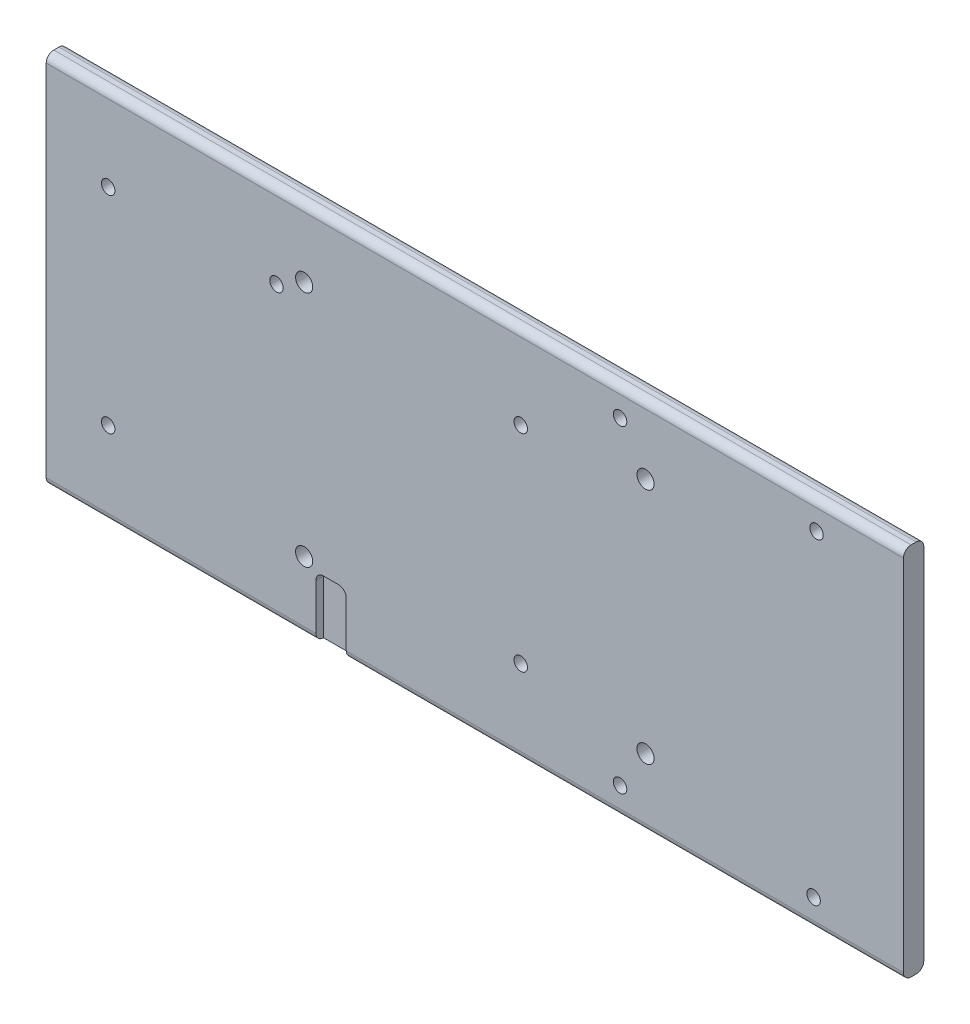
ISO-10303-21;
HEADER;
FILE_DESCRIPTION(('STEP AP214'),'2;1');
FILE_NAME('part.step','',(''),(''),'','','');
FILE_SCHEMA(('AUTOMOTIVE_DESIGN { 1 0 10303 214 1 1 1 1 }'));
ENDSEC;
DATA;
#1=APPLICATION_CONTEXT('core data for automotive mechanical design processes');
#2=APPLICATION_PROTOCOL_DEFINITION('international standard','automotive_design',2000,#1);
#3=PRODUCT_CONTEXT('',#1,'mechanical');
#4=PRODUCT('Part','Part','',(#3));
#5=PRODUCT_RELATED_PRODUCT_CATEGORY('part','',(#4));
#6=PRODUCT_DEFINITION_FORMATION('','',#4);
#7=PRODUCT_DEFINITION_CONTEXT('part definition',#1,'design');
#8=PRODUCT_DEFINITION('design','',#6,#7);
#9=PRODUCT_DEFINITION_SHAPE('','',#8);
#10=(LENGTH_UNIT() NAMED_UNIT(*) SI_UNIT(.MILLI.,.METRE.));
#11=(NAMED_UNIT(*) PLANE_ANGLE_UNIT() SI_UNIT($,.RADIAN.));
#12=(NAMED_UNIT(*) SI_UNIT($,.STERADIAN.) SOLID_ANGLE_UNIT());
#13=UNCERTAINTY_MEASURE_WITH_UNIT(LENGTH_MEASURE(1.E-05),#10,'distance_accuracy_value','');
#14=(GEOMETRIC_REPRESENTATION_CONTEXT(3) GLOBAL_UNCERTAINTY_ASSIGNED_CONTEXT((#13)) GLOBAL_UNIT_ASSIGNED_CONTEXT((#10,
#11,#12)) REPRESENTATION_CONTEXT('',''));
#15=CARTESIAN_POINT('',(0.,0.,0.));
#16=DIRECTION('',(0.,0.,1.));
#17=DIRECTION('',(1.,0.,0.));
#18=AXIS2_PLACEMENT_3D('',#15,#16,#17);
#19=CARTESIAN_POINT('',(0.,-5.00000000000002,1.68));
#20=DIRECTION('',(-1.,0.,0.));
#21=DIRECTION('',(0.,-1.,0.));
#22=AXIS2_PLACEMENT_3D('',#19,#20,#21);
#23=CYLINDRICAL_SURFACE('',#22,1.);
#24=CARTESIAN_POINT('',(29.55,-5.00000000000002,1.68));
#25=DIRECTION('',(-1.,0.,0.));
#26=DIRECTION('',(0.,0.,1.));
#27=AXIS2_PLACEMENT_3D('',#24,#25,#26);
#28=CIRCLE('',#27,1.);
#29=CARTESIAN_POINT('',(29.55,-5.00000000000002,2.68));
#30=VERTEX_POINT('',#29);
#31=CARTESIAN_POINT('',(29.55,-6.00000000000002,1.68));
#32=VERTEX_POINT('',#31);
#33=EDGE_CURVE('E177',#30,#32,#28,.F.);
#34=ORIENTED_EDGE('',*,*,#33,.F.);
#35=DIRECTION('',(1.,0.,0.));
#36=VECTOR('',#35,1.);
#37=CARTESIAN_POINT('',(0.,-5.00000000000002,2.68));
#38=LINE('',#37,#36);
#39=CARTESIAN_POINT('',(-6.,-5.00000000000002,2.68));
#40=VERTEX_POINT('',#39);
#41=EDGE_CURVE('E288',#40,#30,#38,.T.);
#42=ORIENTED_EDGE('',*,*,#41,.F.);
#43=CARTESIAN_POINT('',(-6.,-5.00000000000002,1.68));
#44=DIRECTION('',(-1.,0.,0.));
#45=DIRECTION('',(0.,-1.,0.));
#46=AXIS2_PLACEMENT_3D('',#43,#44,#45);
#47=CIRCLE('',#46,1.);
#48=CARTESIAN_POINT('',(-6.,-6.00000000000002,1.68));
#49=VERTEX_POINT('',#48);
#50=EDGE_CURVE('E295',#49,#40,#47,.T.);
#51=ORIENTED_EDGE('',*,*,#50,.F.);
#52=DIRECTION('',(1.,0.,0.));
#53=VECTOR('',#52,1.);
#54=CARTESIAN_POINT('',(0.,-6.00000000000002,1.68));
#55=LINE('',#54,#53);
#56=EDGE_CURVE('E291',#32,#49,#55,.F.);
#57=ORIENTED_EDGE('',*,*,#56,.F.);
#58=EDGE_LOOP('',(#34,#42,#51,#57));
#59=FACE_BOUND('',#58,.T.);
#60=ADVANCED_FACE('F32',(#59),#23,.T.);
#61=CARTESIAN_POINT('',(0.,42.32,1.));
#62=DIRECTION('',(1.,0.,0.));
#63=DIRECTION('',(0.,1.,0.));
#64=AXIS2_PLACEMENT_3D('',#61,#62,#63);
#65=CYLINDRICAL_SURFACE('',#64,1.);
#66=DIRECTION('',(1.,0.,0.));
#67=VECTOR('',#66,1.);
#68=CARTESIAN_POINT('',(0.,42.32,0.));
#69=LINE('',#68,#67);
#70=CARTESIAN_POINT('',(-6.00000000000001,42.32,0.));
#71=VERTEX_POINT('',#70);
#72=CARTESIAN_POINT('',(107.,42.32,0.));
#73=VERTEX_POINT('',#72);
#74=EDGE_CURVE('E310',#71,#73,#69,.T.);
#75=ORIENTED_EDGE('',*,*,#74,.F.);
#76=CARTESIAN_POINT('',(-6.00000000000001,42.32,1.));
#77=DIRECTION('',(-1.,0.,0.));
#78=DIRECTION('',(0.,-1.,0.));
#79=AXIS2_PLACEMENT_3D('',#76,#77,#78);
#80=CIRCLE('',#79,1.);
#81=CARTESIAN_POINT('',(-6.00000000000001,43.32,0.999999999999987));
#82=VERTEX_POINT('',#81);
#83=EDGE_CURVE('E316',#82,#71,#80,.T.);
#84=ORIENTED_EDGE('',*,*,#83,.F.);
#85=DIRECTION('',(1.,0.,0.));
#86=VECTOR('',#85,1.);
#87=CARTESIAN_POINT('',(107.,43.32,1.));
#88=LINE('',#87,#86);
#89=CARTESIAN_POINT('',(107.,43.32,0.999999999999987));
#90=VERTEX_POINT('',#89);
#91=EDGE_CURVE('E313',#90,#82,#88,.F.);
#92=ORIENTED_EDGE('',*,*,#91,.F.);
#93=CARTESIAN_POINT('',(107.,42.32,1.));
#94=DIRECTION('',(1.,0.,0.));
#95=DIRECTION('',(0.,0.,-1.));
#96=AXIS2_PLACEMENT_3D('',#93,#94,#95);
#97=CIRCLE('',#96,1.);
#98=EDGE_CURVE('E40',#73,#90,#97,.T.);
#99=ORIENTED_EDGE('',*,*,#98,.F.);
#100=EDGE_LOOP('',(#75,#84,#92,#99));
#101=FACE_BOUND('',#100,.T.);
#102=ADVANCED_FACE('F34',(#101),#65,.T.);
#103=CARTESIAN_POINT('',(0.,-5.00000000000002,1.));
#104=DIRECTION('',(-1.,0.,0.));
#105=DIRECTION('',(0.,-1.,0.));
#106=AXIS2_PLACEMENT_3D('',#103,#104,#105);
#107=CYLINDRICAL_SURFACE('',#106,1.);
#108=DIRECTION('',(-1.,0.,0.));
#109=VECTOR('',#108,1.);
#110=CARTESIAN_POINT('',(0.,-5.00000000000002,0.));
#111=LINE('',#110,#109);
#112=CARTESIAN_POINT('',(107.,-5.00000000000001,0.));
#113=VERTEX_POINT('',#112);
#114=CARTESIAN_POINT('',(-6.,-5.00000000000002,0.));
#115=VERTEX_POINT('',#114);
#116=EDGE_CURVE('E300',#113,#115,#111,.T.);
#117=ORIENTED_EDGE('',*,*,#116,.F.);
#118=CARTESIAN_POINT('',(107.,-5.00000000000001,1.));
#119=DIRECTION('',(1.,0.,0.));
#120=DIRECTION('',(0.,0.,-1.));
#121=AXIS2_PLACEMENT_3D('',#118,#119,#120);
#122=CIRCLE('',#121,1.);
#123=CARTESIAN_POINT('',(107.,-6.00000000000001,0.999999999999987));
#124=VERTEX_POINT('',#123);
#125=EDGE_CURVE('E306',#124,#113,#122,.T.);
#126=ORIENTED_EDGE('',*,*,#125,.F.);
#127=DIRECTION('',(-1.,0.,0.));
#128=VECTOR('',#127,1.);
#129=CARTESIAN_POINT('',(107.,-6.00000000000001,1.));
#130=LINE('',#129,#128);
#131=CARTESIAN_POINT('',(-6.,-6.00000000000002,0.999999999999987));
#132=VERTEX_POINT('',#131);
#133=EDGE_CURVE('E303',#132,#124,#130,.F.);
#134=ORIENTED_EDGE('',*,*,#133,.F.);
#135=CARTESIAN_POINT('',(-6.,-5.00000000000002,1.));
#136=DIRECTION('',(-1.,0.,0.));
#137=DIRECTION('',(0.,-1.,0.));
#138=AXIS2_PLACEMENT_3D('',#135,#136,#137);
#139=CIRCLE('',#138,1.);
#140=EDGE_CURVE('E308',#115,#132,#139,.T.);
#141=ORIENTED_EDGE('',*,*,#140,.F.);
#142=EDGE_LOOP('',(#117,#126,#134,#141));
#143=FACE_BOUND('',#142,.T.);
#144=ADVANCED_FACE('F329',(#143),#107,.T.);
#145=CARTESIAN_POINT('',(33.55,-5.00000000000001,1.68));
#146=DIRECTION('',(1.,0.,0.));
#147=DIRECTION('',(0.,0.,-1.));
#148=AXIS2_PLACEMENT_3D('',#145,#146,#147);
#149=CIRCLE('',#148,1.);
#150=CARTESIAN_POINT('',(33.55,-6.00000000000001,1.68));
#151=VERTEX_POINT('',#150);
#152=CARTESIAN_POINT('',(33.55,-5.00000000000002,2.68));
#153=VERTEX_POINT('',#152);
#154=EDGE_CURVE('E172',#151,#153,#149,.F.);
#155=ORIENTED_EDGE('',*,*,#154,.F.);
#156=CARTESIAN_POINT('',(107.,-6.00000000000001,1.68));
#157=VERTEX_POINT('',#156);
#158=EDGE_CURVE('E292',#157,#151,#55,.F.);
#159=ORIENTED_EDGE('',*,*,#158,.F.);
#160=CARTESIAN_POINT('',(107.,-5.00000000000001,1.68));
#161=DIRECTION('',(1.,0.,0.));
#162=DIRECTION('',(0.,0.,-1.));
#163=AXIS2_PLACEMENT_3D('',#160,#161,#162);
#164=CIRCLE('',#163,1.);
#165=CARTESIAN_POINT('',(107.,-5.00000000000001,2.68));
#166=VERTEX_POINT('',#165);
#167=EDGE_CURVE('E297',#166,#157,#164,.T.);
#168=ORIENTED_EDGE('',*,*,#167,.F.);
#169=EDGE_CURVE('E287',#153,#166,#38,.T.);
#170=ORIENTED_EDGE('',*,*,#169,.F.);
#171=EDGE_LOOP('',(#155,#159,#168,#170));
#172=FACE_BOUND('',#171,.T.);
#173=ADVANCED_FACE('F357',(#172),#23,.T.);
#174=CARTESIAN_POINT('',(0.,42.32,1.68));
#175=DIRECTION('',(1.,0.,0.));
#176=DIRECTION('',(0.,1.,0.));
#177=AXIS2_PLACEMENT_3D('',#174,#175,#176);
#178=CYLINDRICAL_SURFACE('',#177,1.);
#179=DIRECTION('',(-1.,0.,0.));
#180=VECTOR('',#179,1.);
#181=CARTESIAN_POINT('',(0.,42.32,2.68));
#182=LINE('',#181,#180);
#183=CARTESIAN_POINT('',(107.,42.32,2.68));
#184=VERTEX_POINT('',#183);
#185=CARTESIAN_POINT('',(-6.00000000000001,42.32,2.68));
#186=VERTEX_POINT('',#185);
#187=EDGE_CURVE('E273',#184,#186,#182,.T.);
#188=ORIENTED_EDGE('',*,*,#187,.F.);
#189=CARTESIAN_POINT('',(107.,42.32,1.68));
#190=DIRECTION('',(1.,0.,0.));
#191=DIRECTION('',(0.,0.,-1.));
#192=AXIS2_PLACEMENT_3D('',#189,#190,#191);
#193=CIRCLE('',#192,1.);
#194=CARTESIAN_POINT('',(107.,43.32,1.68));
#195=VERTEX_POINT('',#194);
#196=EDGE_CURVE('E281',#195,#184,#193,.T.);
#197=ORIENTED_EDGE('',*,*,#196,.F.);
#198=DIRECTION('',(-1.,0.,0.));
#199=VECTOR('',#198,1.);
#200=CARTESIAN_POINT('',(0.,43.32,1.68));
#201=LINE('',#200,#199);
#202=CARTESIAN_POINT('',(-6.00000000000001,43.32,1.68));
#203=VERTEX_POINT('',#202);
#204=EDGE_CURVE('E278',#203,#195,#201,.F.);
#205=ORIENTED_EDGE('',*,*,#204,.F.);
#206=CARTESIAN_POINT('',(-6.00000000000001,42.32,1.68));
#207=DIRECTION('',(-1.,0.,0.));
#208=DIRECTION('',(0.,-1.,0.));
#209=AXIS2_PLACEMENT_3D('',#206,#207,#208);
#210=CIRCLE('',#209,1.);
#211=EDGE_CURVE('E284',#186,#203,#210,.T.);
#212=ORIENTED_EDGE('',*,*,#211,.F.);
#213=EDGE_LOOP('',(#188,#197,#205,#212));
#214=FACE_BOUND('',#213,.T.);
#215=ADVANCED_FACE('F346',(#214),#178,.T.);
#216=CARTESIAN_POINT('',(0.,37.32,2.68));
#217=DIRECTION('',(0.,0.,-1.));
#218=DIRECTION('',(-1.,0.,0.));
#219=AXIS2_PLACEMENT_3D('',#216,#217,#218);
#220=PLANE('',#219);
#221=CARTESIAN_POINT('',(69.640955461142,-2.31578707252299,2.68));
#222=DIRECTION('',(0.,0.,-1.));
#223=DIRECTION('',(-1.,0.,0.));
#224=AXIS2_PLACEMENT_3D('',#221,#222,#223);
#225=CIRCLE('',#224,0.889000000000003);
#226=CARTESIAN_POINT('',(68.751955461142,-2.31578707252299,2.68));
#227=VERTEX_POINT('',#226);
#228=EDGE_CURVE('E180',#227,#227,#225,.T.);
#229=ORIENTED_EDGE('',*,*,#228,.T.);
#230=EDGE_LOOP('',(#229));
#231=FACE_BOUND('',#230,.T.);
#232=CARTESIAN_POINT('',(95.1549255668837,-2.31578707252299,2.68));
#233=DIRECTION('',(0.,0.,-1.));
#234=DIRECTION('',(-1.,0.,0.));
#235=AXIS2_PLACEMENT_3D('',#232,#233,#234);
#236=CIRCLE('',#235,0.889000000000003);
#237=CARTESIAN_POINT('',(94.2659255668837,-2.31578707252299,2.68));
#238=VERTEX_POINT('',#237);
#239=EDGE_CURVE('E186',#238,#238,#236,.T.);
#240=ORIENTED_EDGE('',*,*,#239,.T.);
#241=EDGE_LOOP('',(#240));
#242=FACE_BOUND('',#241,.T.);
#243=CARTESIAN_POINT('',(95.5374680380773,39.635787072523,2.68));
#244=DIRECTION('',(0.,0.,-1.));
#245=DIRECTION('',(-1.,0.,0.));
#246=AXIS2_PLACEMENT_3D('',#243,#244,#245);
#247=CIRCLE('',#246,0.889000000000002);
#248=CARTESIAN_POINT('',(94.6484680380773,39.635787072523,2.68));
#249=VERTEX_POINT('',#248);
#250=EDGE_CURVE('E192',#249,#249,#247,.T.);
#251=ORIENTED_EDGE('',*,*,#250,.T.);
#252=EDGE_LOOP('',(#251));
#253=FACE_BOUND('',#252,.T.);
#254=CARTESIAN_POINT('',(69.640955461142,39.635787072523,2.68));
#255=DIRECTION('',(0.,0.,-1.));
#256=DIRECTION('',(-1.,0.,0.));
#257=AXIS2_PLACEMENT_3D('',#254,#255,#256);
#258=CIRCLE('',#257,0.889000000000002);
#259=CARTESIAN_POINT('',(68.751955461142,39.635787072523,2.68));
#260=VERTEX_POINT('',#259);
#261=EDGE_CURVE('E198',#260,#260,#258,.T.);
#262=ORIENTED_EDGE('',*,*,#261,.T.);
#263=EDGE_LOOP('',(#262));
#264=FACE_BOUND('',#263,.T.);
#265=CARTESIAN_POINT('',(2.16398911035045,32.27,2.68));
#266=DIRECTION('',(0.,0.,-1.));
#267=DIRECTION('',(-1.,0.,0.));
#268=AXIS2_PLACEMENT_3D('',#265,#266,#267);
#269=CIRCLE('',#268,0.888999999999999);
#270=CARTESIAN_POINT('',(1.27498911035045,32.27,2.68));
#271=VERTEX_POINT('',#270);
#272=EDGE_CURVE('E204',#271,#271,#269,.T.);
#273=ORIENTED_EDGE('',*,*,#272,.T.);
#274=EDGE_LOOP('',(#273));
#275=FACE_BOUND('',#274,.T.);
#276=CARTESIAN_POINT('',(56.55,32.27,2.68));
#277=DIRECTION('',(0.,0.,-1.));
#278=DIRECTION('',(-1.,0.,0.));
#279=AXIS2_PLACEMENT_3D('',#276,#277,#278);
#280=CIRCLE('',#279,0.889000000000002);
#281=CARTESIAN_POINT('',(55.661,32.27,2.68));
#282=VERTEX_POINT('',#281);
#283=EDGE_CURVE('E210',#282,#282,#280,.T.);
#284=ORIENTED_EDGE('',*,*,#283,.T.);
#285=EDGE_LOOP('',(#284));
#286=FACE_BOUND('',#285,.T.);
#287=CARTESIAN_POINT('',(56.55,5.05,2.68));
#288=DIRECTION('',(0.,0.,-1.));
#289=DIRECTION('',(-1.,0.,0.));
#290=AXIS2_PLACEMENT_3D('',#287,#288,#289);
#291=CIRCLE('',#290,0.889000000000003);
#292=CARTESIAN_POINT('',(55.661,5.05,2.68));
#293=VERTEX_POINT('',#292);
#294=EDGE_CURVE('E216',#293,#293,#291,.T.);
#295=ORIENTED_EDGE('',*,*,#294,.T.);
#296=EDGE_LOOP('',(#295));
#297=FACE_BOUND('',#296,.T.);
#298=CARTESIAN_POINT('',(2.16398911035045,5.04999999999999,2.68));
#299=DIRECTION('',(0.,0.,-1.));
#300=DIRECTION('',(-1.,0.,0.));
#301=AXIS2_PLACEMENT_3D('',#298,#299,#300);
#302=CIRCLE('',#301,0.889);
#303=CARTESIAN_POINT('',(1.27498911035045,5.04999999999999,2.68));
#304=VERTEX_POINT('',#303);
#305=EDGE_CURVE('E222',#304,#304,#302,.T.);
#306=ORIENTED_EDGE('',*,*,#305,.T.);
#307=EDGE_LOOP('',(#306));
#308=FACE_BOUND('',#307,.T.);
#309=CARTESIAN_POINT('',(24.355,32.27,2.68));
#310=DIRECTION('',(0.,0.,-1.));
#311=DIRECTION('',(-1.,0.,0.));
#312=AXIS2_PLACEMENT_3D('',#309,#310,#311);
#313=CIRCLE('',#312,0.888999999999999);
#314=CARTESIAN_POINT('',(23.466,32.27,2.68));
#315=VERTEX_POINT('',#314);
#316=EDGE_CURVE('E228',#315,#315,#313,.T.);
#317=ORIENTED_EDGE('',*,*,#316,.T.);
#318=EDGE_LOOP('',(#317));
#319=FACE_BOUND('',#318,.T.);
#320=CARTESIAN_POINT('',(73.,3.,2.68));
#321=DIRECTION('',(0.,0.,-1.));
#322=DIRECTION('',(-1.,0.,0.));
#323=AXIS2_PLACEMENT_3D('',#320,#321,#322);
#324=CIRCLE('',#323,1.1303);
#325=CARTESIAN_POINT('',(71.8697,3.,2.68));
#326=VERTEX_POINT('',#325);
#327=EDGE_CURVE('E252',#326,#326,#324,.T.);
#328=ORIENTED_EDGE('',*,*,#327,.T.);
#329=EDGE_LOOP('',(#328));
#330=FACE_BOUND('',#329,.T.);
#331=CARTESIAN_POINT('',(73.,34.32,2.68));
#332=DIRECTION('',(0.,0.,-1.));
#333=DIRECTION('',(-1.,0.,0.));
#334=AXIS2_PLACEMENT_3D('',#331,#332,#333);
#335=CIRCLE('',#334,1.1303);
#336=CARTESIAN_POINT('',(71.8697,34.32,2.68));
#337=VERTEX_POINT('',#336);
#338=EDGE_CURVE('E258',#337,#337,#335,.T.);
#339=ORIENTED_EDGE('',*,*,#338,.T.);
#340=EDGE_LOOP('',(#339));
#341=FACE_BOUND('',#340,.T.);
#342=CARTESIAN_POINT('',(28.,34.32,2.68));
#343=DIRECTION('',(0.,0.,-1.));
#344=DIRECTION('',(-1.,0.,0.));
#345=AXIS2_PLACEMENT_3D('',#342,#343,#344);
#346=CIRCLE('',#345,1.1303);
#347=CARTESIAN_POINT('',(26.8697,34.32,2.68));
#348=VERTEX_POINT('',#347);
#349=EDGE_CURVE('E264',#348,#348,#346,.T.);
#350=ORIENTED_EDGE('',*,*,#349,.T.);
#351=EDGE_LOOP('',(#350));
#352=FACE_BOUND('',#351,.T.);
#353=CARTESIAN_POINT('',(28.,3.,2.68));
#354=DIRECTION('',(0.,0.,-1.));
#355=DIRECTION('',(-1.,0.,0.));
#356=AXIS2_PLACEMENT_3D('',#353,#354,#355);
#357=CIRCLE('',#356,1.1303);
#358=CARTESIAN_POINT('',(26.8697,3.,2.68));
#359=VERTEX_POINT('',#358);
#360=EDGE_CURVE('E270',#359,#359,#357,.T.);
#361=ORIENTED_EDGE('',*,*,#360,.T.);
#362=EDGE_LOOP('',(#361));
#363=FACE_BOUND('',#362,.T.);
#364=ORIENTED_EDGE('',*,*,#41,.T.);
#365=DIRECTION('',(0.,-1.,0.));
#366=VECTOR('',#365,1.);
#367=CARTESIAN_POINT('',(29.55,-5.00000000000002,2.68));
#368=LINE('',#367,#366);
#369=CARTESIAN_POINT('',(29.55,1.04999999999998,2.68));
#370=VERTEX_POINT('',#369);
#371=EDGE_CURVE('E142',#370,#30,#368,.T.);
#372=ORIENTED_EDGE('',*,*,#371,.F.);
#373=CARTESIAN_POINT('',(30.55,1.04999999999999,2.68));
#374=DIRECTION('',(0.,0.,1.));
#375=DIRECTION('',(1.,0.,0.));
#376=AXIS2_PLACEMENT_3D('',#373,#374,#375);
#377=CIRCLE('',#376,1.);
#378=CARTESIAN_POINT('',(30.55,2.04999999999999,2.68));
#379=VERTEX_POINT('',#378);
#380=EDGE_CURVE('E166',#379,#370,#377,.T.);
#381=ORIENTED_EDGE('',*,*,#380,.F.);
#382=DIRECTION('',(-1.,0.,0.));
#383=VECTOR('',#382,1.);
#384=CARTESIAN_POINT('',(30.55,2.04999999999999,2.68));
#385=LINE('',#384,#383);
#386=CARTESIAN_POINT('',(32.55,2.04999999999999,2.68));
#387=VERTEX_POINT('',#386);
#388=EDGE_CURVE('E163',#387,#379,#385,.T.);
#389=ORIENTED_EDGE('',*,*,#388,.F.);
#390=CARTESIAN_POINT('',(32.55,1.04999999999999,2.68));
#391=DIRECTION('',(0.,0.,1.));
#392=DIRECTION('',(1.,0.,0.));
#393=AXIS2_PLACEMENT_3D('',#390,#391,#392);
#394=CIRCLE('',#393,1.);
#395=CARTESIAN_POINT('',(33.55,1.04999999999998,2.68));
#396=VERTEX_POINT('',#395);
#397=EDGE_CURVE('E161',#396,#387,#394,.T.);
#398=ORIENTED_EDGE('',*,*,#397,.F.);
#399=DIRECTION('',(0.,-1.,0.));
#400=VECTOR('',#399,1.);
#401=CARTESIAN_POINT('',(33.55,37.32,2.68));
#402=LINE('',#401,#400);
#403=EDGE_CURVE('E11',#396,#153,#402,.T.);
#404=ORIENTED_EDGE('',*,*,#403,.T.);
#405=ORIENTED_EDGE('',*,*,#169,.T.);
#406=DIRECTION('',(0.,1.,0.));
#407=VECTOR('',#406,1.);
#408=CARTESIAN_POINT('',(107.,-6.00000000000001,2.68));
#409=LINE('',#408,#407);
#410=EDGE_CURVE('E238',#166,#184,#409,.T.);
#411=ORIENTED_EDGE('',*,*,#410,.T.);
#412=ORIENTED_EDGE('',*,*,#187,.T.);
#413=DIRECTION('',(0.,-1.,0.));
#414=VECTOR('',#413,1.);
#415=CARTESIAN_POINT('',(-6.,-6.00000000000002,2.68));
#416=LINE('',#415,#414);
#417=EDGE_CURVE('E234',#186,#40,#416,.T.);
#418=ORIENTED_EDGE('',*,*,#417,.T.);
#419=EDGE_LOOP('',(#364,#372,#381,#389,#398,#404,#405,#411,#412,#418));
#420=FACE_BOUND('',#419,.T.);
#421=ADVANCED_FACE('F341',(#231,#242,#253,#264,#275,#286,#297,#308,#319,#330,#341,#352,#363,
#420),#220,.F.);
#422=CARTESIAN_POINT('',(0.,37.32,0.));
#423=DIRECTION('',(0.,0.,-1.));
#424=DIRECTION('',(-1.,0.,0.));
#425=AXIS2_PLACEMENT_3D('',#422,#423,#424);
#426=PLANE('',#425);
#427=CARTESIAN_POINT('',(69.640955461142,-2.31578707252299,0.));
#428=DIRECTION('',(0.,0.,-1.));
#429=DIRECTION('',(-1.,0.,0.));
#430=AXIS2_PLACEMENT_3D('',#427,#428,#429);
#431=CIRCLE('',#430,0.889000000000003);
#432=CARTESIAN_POINT('',(68.751955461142,-2.31578707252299,0.));
#433=VERTEX_POINT('',#432);
#434=EDGE_CURVE('E179',#433,#433,#431,.T.);
#435=ORIENTED_EDGE('',*,*,#434,.F.);
#436=EDGE_LOOP('',(#435));
#437=FACE_BOUND('',#436,.T.);
#438=CARTESIAN_POINT('',(95.1549255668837,-2.31578707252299,0.));
#439=DIRECTION('',(0.,0.,-1.));
#440=DIRECTION('',(-1.,0.,0.));
#441=AXIS2_PLACEMENT_3D('',#438,#439,#440);
#442=CIRCLE('',#441,0.889000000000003);
#443=CARTESIAN_POINT('',(94.2659255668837,-2.31578707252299,0.));
#444=VERTEX_POINT('',#443);
#445=EDGE_CURVE('E183',#444,#444,#442,.T.);
#446=ORIENTED_EDGE('',*,*,#445,.F.);
#447=EDGE_LOOP('',(#446));
#448=FACE_BOUND('',#447,.T.);
#449=CARTESIAN_POINT('',(95.5374680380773,39.635787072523,0.));
#450=DIRECTION('',(0.,0.,-1.));
#451=DIRECTION('',(-1.,0.,0.));
#452=AXIS2_PLACEMENT_3D('',#449,#450,#451);
#453=CIRCLE('',#452,0.889000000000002);
#454=CARTESIAN_POINT('',(94.6484680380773,39.635787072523,0.));
#455=VERTEX_POINT('',#454);
#456=EDGE_CURVE('E189',#455,#455,#453,.T.);
#457=ORIENTED_EDGE('',*,*,#456,.F.);
#458=EDGE_LOOP('',(#457));
#459=FACE_BOUND('',#458,.T.);
#460=CARTESIAN_POINT('',(69.640955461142,39.635787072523,0.));
#461=DIRECTION('',(0.,0.,-1.));
#462=DIRECTION('',(-1.,0.,0.));
#463=AXIS2_PLACEMENT_3D('',#460,#461,#462);
#464=CIRCLE('',#463,0.889000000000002);
#465=CARTESIAN_POINT('',(68.751955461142,39.635787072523,0.));
#466=VERTEX_POINT('',#465);
#467=EDGE_CURVE('E195',#466,#466,#464,.T.);
#468=ORIENTED_EDGE('',*,*,#467,.F.);
#469=EDGE_LOOP('',(#468));
#470=FACE_BOUND('',#469,.T.);
#471=CARTESIAN_POINT('',(2.16398911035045,32.27,0.));
#472=DIRECTION('',(0.,0.,-1.));
#473=DIRECTION('',(-1.,0.,0.));
#474=AXIS2_PLACEMENT_3D('',#471,#472,#473);
#475=CIRCLE('',#474,0.888999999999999);
#476=CARTESIAN_POINT('',(1.27498911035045,32.27,0.));
#477=VERTEX_POINT('',#476);
#478=EDGE_CURVE('E201',#477,#477,#475,.T.);
#479=ORIENTED_EDGE('',*,*,#478,.F.);
#480=EDGE_LOOP('',(#479));
#481=FACE_BOUND('',#480,.T.);
#482=CARTESIAN_POINT('',(56.55,32.27,0.));
#483=DIRECTION('',(0.,0.,-1.));
#484=DIRECTION('',(-1.,0.,0.));
#485=AXIS2_PLACEMENT_3D('',#482,#483,#484);
#486=CIRCLE('',#485,0.889000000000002);
#487=CARTESIAN_POINT('',(55.661,32.27,0.));
#488=VERTEX_POINT('',#487);
#489=EDGE_CURVE('E207',#488,#488,#486,.T.);
#490=ORIENTED_EDGE('',*,*,#489,.F.);
#491=EDGE_LOOP('',(#490));
#492=FACE_BOUND('',#491,.T.);
#493=CARTESIAN_POINT('',(56.55,5.05,0.));
#494=DIRECTION('',(0.,0.,-1.));
#495=DIRECTION('',(-1.,0.,0.));
#496=AXIS2_PLACEMENT_3D('',#493,#494,#495);
#497=CIRCLE('',#496,0.889000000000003);
#498=CARTESIAN_POINT('',(55.661,5.05,0.));
#499=VERTEX_POINT('',#498);
#500=EDGE_CURVE('E213',#499,#499,#497,.T.);
#501=ORIENTED_EDGE('',*,*,#500,.F.);
#502=EDGE_LOOP('',(#501));
#503=FACE_BOUND('',#502,.T.);
#504=CARTESIAN_POINT('',(2.16398911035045,5.04999999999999,0.));
#505=DIRECTION('',(0.,0.,-1.));
#506=DIRECTION('',(-1.,0.,0.));
#507=AXIS2_PLACEMENT_3D('',#504,#505,#506);
#508=CIRCLE('',#507,0.889);
#509=CARTESIAN_POINT('',(1.27498911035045,5.04999999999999,0.));
#510=VERTEX_POINT('',#509);
#511=EDGE_CURVE('E219',#510,#510,#508,.T.);
#512=ORIENTED_EDGE('',*,*,#511,.F.);
#513=EDGE_LOOP('',(#512));
#514=FACE_BOUND('',#513,.T.);
#515=CARTESIAN_POINT('',(24.355,32.27,0.));
#516=DIRECTION('',(0.,0.,-1.));
#517=DIRECTION('',(-1.,0.,0.));
#518=AXIS2_PLACEMENT_3D('',#515,#516,#517);
#519=CIRCLE('',#518,0.888999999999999);
#520=CARTESIAN_POINT('',(23.466,32.27,0.));
#521=VERTEX_POINT('',#520);
#522=EDGE_CURVE('E225',#521,#521,#519,.T.);
#523=ORIENTED_EDGE('',*,*,#522,.F.);
#524=EDGE_LOOP('',(#523));
#525=FACE_BOUND('',#524,.T.);
#526=CARTESIAN_POINT('',(73.,3.,0.));
#527=DIRECTION('',(0.,0.,-1.));
#528=DIRECTION('',(-1.,0.,0.));
#529=AXIS2_PLACEMENT_3D('',#526,#527,#528);
#530=CIRCLE('',#529,1.1303);
#531=CARTESIAN_POINT('',(71.8697,3.,0.));
#532=VERTEX_POINT('',#531);
#533=EDGE_CURVE('E237',#532,#532,#530,.T.);
#534=ORIENTED_EDGE('',*,*,#533,.F.);
#535=EDGE_LOOP('',(#534));
#536=FACE_BOUND('',#535,.T.);
#537=CARTESIAN_POINT('',(73.,34.32,0.));
#538=DIRECTION('',(0.,0.,-1.));
#539=DIRECTION('',(-1.,0.,0.));
#540=AXIS2_PLACEMENT_3D('',#537,#538,#539);
#541=CIRCLE('',#540,1.1303);
#542=CARTESIAN_POINT('',(71.8697,34.32,0.));
#543=VERTEX_POINT('',#542);
#544=EDGE_CURVE('E255',#543,#543,#541,.T.);
#545=ORIENTED_EDGE('',*,*,#544,.F.);
#546=EDGE_LOOP('',(#545));
#547=FACE_BOUND('',#546,.T.);
#548=CARTESIAN_POINT('',(28.,34.32,0.));
#549=DIRECTION('',(0.,0.,-1.));
#550=DIRECTION('',(-1.,0.,0.));
#551=AXIS2_PLACEMENT_3D('',#548,#549,#550);
#552=CIRCLE('',#551,1.1303);
#553=CARTESIAN_POINT('',(26.8697,34.32,0.));
#554=VERTEX_POINT('',#553);
#555=EDGE_CURVE('E261',#554,#554,#552,.T.);
#556=ORIENTED_EDGE('',*,*,#555,.F.);
#557=EDGE_LOOP('',(#556));
#558=FACE_BOUND('',#557,.T.);
#559=CARTESIAN_POINT('',(28.,3.,0.));
#560=DIRECTION('',(0.,0.,-1.));
#561=DIRECTION('',(-1.,0.,0.));
#562=AXIS2_PLACEMENT_3D('',#559,#560,#561);
#563=CIRCLE('',#562,1.1303);
#564=CARTESIAN_POINT('',(26.8697,3.,0.));
#565=VERTEX_POINT('',#564);
#566=EDGE_CURVE('E267',#565,#565,#563,.T.);
#567=ORIENTED_EDGE('',*,*,#566,.F.);
#568=EDGE_LOOP('',(#567));
#569=FACE_BOUND('',#568,.T.);
#570=DIRECTION('',(0.,-1.,0.));
#571=VECTOR('',#570,1.);
#572=CARTESIAN_POINT('',(-6.,-6.00000000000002,0.));
#573=LINE('',#572,#571);
#574=EDGE_CURVE('E243',#71,#115,#573,.T.);
#575=ORIENTED_EDGE('',*,*,#574,.F.);
#576=ORIENTED_EDGE('',*,*,#74,.T.);
#577=DIRECTION('',(0.,1.,0.));
#578=VECTOR('',#577,1.);
#579=CARTESIAN_POINT('',(107.,-6.00000000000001,0.));
#580=LINE('',#579,#578);
#581=EDGE_CURVE('E231',#113,#73,#580,.T.);
#582=ORIENTED_EDGE('',*,*,#581,.F.);
#583=ORIENTED_EDGE('',*,*,#116,.T.);
#584=EDGE_LOOP('',(#575,#576,#582,#583));
#585=FACE_BOUND('',#584,.T.);
#586=ADVANCED_FACE('F326',(#437,#448,#459,#470,#481,#492,#503,#514,#525,#536,#547,#558,#569,
#585),#426,.T.);
#587=CARTESIAN_POINT('',(28.,3.,2.68));
#588=DIRECTION('',(0.,0.,-1.));
#589=DIRECTION('',(-1.,0.,0.));
#590=AXIS2_PLACEMENT_3D('',#587,#588,#589);
#591=CYLINDRICAL_SURFACE('',#590,1.1303);
#592=ORIENTED_EDGE('',*,*,#360,.F.);
#593=EDGE_LOOP('',(#592));
#594=FACE_BOUND('',#593,.T.);
#595=ORIENTED_EDGE('',*,*,#566,.T.);
#596=EDGE_LOOP('',(#595));
#597=FACE_BOUND('',#596,.T.);
#598=ADVANCED_FACE('F396',(#594,#597),#591,.F.);
#599=CARTESIAN_POINT('',(28.,34.32,2.68));
#600=DIRECTION('',(0.,0.,-1.));
#601=DIRECTION('',(-1.,0.,0.));
#602=AXIS2_PLACEMENT_3D('',#599,#600,#601);
#603=CYLINDRICAL_SURFACE('',#602,1.1303);
#604=ORIENTED_EDGE('',*,*,#349,.F.);
#605=EDGE_LOOP('',(#604));
#606=FACE_BOUND('',#605,.T.);
#607=ORIENTED_EDGE('',*,*,#555,.T.);
#608=EDGE_LOOP('',(#607));
#609=FACE_BOUND('',#608,.T.);
#610=ADVANCED_FACE('F557',(#606,#609),#603,.F.);
#611=CARTESIAN_POINT('',(73.,34.32,2.68));
#612=DIRECTION('',(0.,0.,-1.));
#613=DIRECTION('',(-1.,0.,0.));
#614=AXIS2_PLACEMENT_3D('',#611,#612,#613);
#615=CYLINDRICAL_SURFACE('',#614,1.1303);
#616=ORIENTED_EDGE('',*,*,#338,.F.);
#617=EDGE_LOOP('',(#616));
#618=FACE_BOUND('',#617,.T.);
#619=ORIENTED_EDGE('',*,*,#544,.T.);
#620=EDGE_LOOP('',(#619));
#621=FACE_BOUND('',#620,.T.);
#622=ADVANCED_FACE('F563',(#618,#621),#615,.F.);
#623=CARTESIAN_POINT('',(73.,3.,2.68));
#624=DIRECTION('',(0.,0.,-1.));
#625=DIRECTION('',(-1.,0.,0.));
#626=AXIS2_PLACEMENT_3D('',#623,#624,#625);
#627=CYLINDRICAL_SURFACE('',#626,1.1303);
#628=ORIENTED_EDGE('',*,*,#327,.F.);
#629=EDGE_LOOP('',(#628));
#630=FACE_BOUND('',#629,.T.);
#631=ORIENTED_EDGE('',*,*,#533,.T.);
#632=EDGE_LOOP('',(#631));
#633=FACE_BOUND('',#632,.T.);
#634=ADVANCED_FACE('F366',(#630,#633),#627,.F.);
#635=CARTESIAN_POINT('',(107.,-6.00000000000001,-123.294210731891));
#636=DIRECTION('',(1.,0.,0.));
#637=DIRECTION('',(0.,0.,-1.));
#638=AXIS2_PLACEMENT_3D('',#635,#636,#637);
#639=PLANE('',#638);
#640=ORIENTED_EDGE('',*,*,#581,.T.);
#641=ORIENTED_EDGE('',*,*,#98,.T.);
#642=DIRECTION('',(0.,0.,1.));
#643=VECTOR('',#642,1.);
#644=CARTESIAN_POINT('',(107.,43.32,-123.294210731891));
#645=LINE('',#644,#643);
#646=EDGE_CURVE('E242',#90,#195,#645,.T.);
#647=ORIENTED_EDGE('',*,*,#646,.T.);
#648=ORIENTED_EDGE('',*,*,#196,.T.);
#649=ORIENTED_EDGE('',*,*,#410,.F.);
#650=ORIENTED_EDGE('',*,*,#167,.T.);
#651=DIRECTION('',(0.,0.,1.));
#652=VECTOR('',#651,1.);
#653=CARTESIAN_POINT('',(107.,-6.00000000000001,-123.294210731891));
#654=LINE('',#653,#652);
#655=EDGE_CURVE('E246',#124,#157,#654,.T.);
#656=ORIENTED_EDGE('',*,*,#655,.F.);
#657=ORIENTED_EDGE('',*,*,#125,.T.);
#658=EDGE_LOOP('',(#640,#641,#647,#648,#649,#650,#656,#657));
#659=FACE_BOUND('',#658,.T.);
#660=ADVANCED_FACE('F350',(#659),#639,.T.);
#661=CARTESIAN_POINT('',(107.,-6.00000000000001,-123.294210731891));
#662=DIRECTION('',(0.,-1.,0.));
#663=DIRECTION('',(1.,0.,0.));
#664=AXIS2_PLACEMENT_3D('',#661,#662,#663);
#665=PLANE('',#664);
#666=DIRECTION('',(0.,0.,1.));
#667=VECTOR('',#666,1.);
#668=CARTESIAN_POINT('',(-6.,-6.00000000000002,-123.294210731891));
#669=LINE('',#668,#667);
#670=EDGE_CURVE('E245',#132,#49,#669,.T.);
#671=ORIENTED_EDGE('',*,*,#670,.F.);
#672=ORIENTED_EDGE('',*,*,#133,.T.);
#673=ORIENTED_EDGE('',*,*,#655,.T.);
#674=ORIENTED_EDGE('',*,*,#158,.T.);
#675=EDGE_CURVE('E139',#151,#32,#55,.F.);
#676=ORIENTED_EDGE('',*,*,#675,.T.);
#677=ORIENTED_EDGE('',*,*,#56,.T.);
#678=EDGE_LOOP('',(#671,#672,#673,#674,#676,#677));
#679=FACE_BOUND('',#678,.T.);
#680=ADVANCED_FACE('F358',(#679),#665,.T.);
#681=CARTESIAN_POINT('',(-6.,-6.00000000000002,-123.294210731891));
#682=DIRECTION('',(-1.,0.,0.));
#683=DIRECTION('',(0.,-1.,0.));
#684=AXIS2_PLACEMENT_3D('',#681,#682,#683);
#685=PLANE('',#684);
#686=DIRECTION('',(0.,0.,1.));
#687=VECTOR('',#686,1.);
#688=CARTESIAN_POINT('',(-6.00000000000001,43.32,-123.294210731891));
#689=LINE('',#688,#687);
#690=EDGE_CURVE('E240',#82,#203,#689,.T.);
#691=ORIENTED_EDGE('',*,*,#690,.F.);
#692=ORIENTED_EDGE('',*,*,#83,.T.);
#693=ORIENTED_EDGE('',*,*,#574,.T.);
#694=ORIENTED_EDGE('',*,*,#140,.T.);
#695=ORIENTED_EDGE('',*,*,#670,.T.);
#696=ORIENTED_EDGE('',*,*,#50,.T.);
#697=ORIENTED_EDGE('',*,*,#417,.F.);
#698=ORIENTED_EDGE('',*,*,#211,.T.);
#699=EDGE_LOOP('',(#691,#692,#693,#694,#695,#696,#697,#698));
#700=FACE_BOUND('',#699,.T.);
#701=ADVANCED_FACE('F320',(#700),#685,.T.);
#702=CARTESIAN_POINT('',(107.,43.32,-123.294210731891));
#703=DIRECTION('',(0.,1.,0.));
#704=DIRECTION('',(-1.,0.,0.));
#705=AXIS2_PLACEMENT_3D('',#702,#703,#704);
#706=PLANE('',#705);
#707=ORIENTED_EDGE('',*,*,#646,.F.);
#708=ORIENTED_EDGE('',*,*,#91,.T.);
#709=ORIENTED_EDGE('',*,*,#690,.T.);
#710=ORIENTED_EDGE('',*,*,#204,.T.);
#711=EDGE_LOOP('',(#707,#708,#709,#710));
#712=FACE_BOUND('',#711,.T.);
#713=ADVANCED_FACE('F349',(#712),#706,.T.);
#714=CARTESIAN_POINT('',(24.355,32.27,2.68));
#715=DIRECTION('',(0.,0.,-1.));
#716=DIRECTION('',(-1.,0.,0.));
#717=AXIS2_PLACEMENT_3D('',#714,#715,#716);
#718=CYLINDRICAL_SURFACE('',#717,0.888999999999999);
#719=ORIENTED_EDGE('',*,*,#316,.F.);
#720=EDGE_LOOP('',(#719));
#721=FACE_BOUND('',#720,.T.);
#722=ORIENTED_EDGE('',*,*,#522,.T.);
#723=EDGE_LOOP('',(#722));
#724=FACE_BOUND('',#723,.T.);
#725=ADVANCED_FACE('F423',(#721,#724),#718,.F.);
#726=CARTESIAN_POINT('',(2.16398911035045,5.04999999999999,2.68));
#727=DIRECTION('',(0.,0.,-1.));
#728=DIRECTION('',(-1.,0.,0.));
#729=AXIS2_PLACEMENT_3D('',#726,#727,#728);
#730=CYLINDRICAL_SURFACE('',#729,0.889);
#731=ORIENTED_EDGE('',*,*,#305,.F.);
#732=EDGE_LOOP('',(#731));
#733=FACE_BOUND('',#732,.T.);
#734=ORIENTED_EDGE('',*,*,#511,.T.);
#735=EDGE_LOOP('',(#734));
#736=FACE_BOUND('',#735,.T.);
#737=ADVANCED_FACE('F536',(#733,#736),#730,.F.);
#738=CARTESIAN_POINT('',(56.55,5.05,2.68));
#739=DIRECTION('',(0.,0.,-1.));
#740=DIRECTION('',(-1.,0.,0.));
#741=AXIS2_PLACEMENT_3D('',#738,#739,#740);
#742=CYLINDRICAL_SURFACE('',#741,0.889000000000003);
#743=ORIENTED_EDGE('',*,*,#294,.F.);
#744=EDGE_LOOP('',(#743));
#745=FACE_BOUND('',#744,.T.);
#746=ORIENTED_EDGE('',*,*,#500,.T.);
#747=EDGE_LOOP('',(#746));
#748=FACE_BOUND('',#747,.T.);
#749=ADVANCED_FACE('F532',(#745,#748),#742,.F.);
#750=CARTESIAN_POINT('',(56.55,32.27,2.68));
#751=DIRECTION('',(0.,0.,-1.));
#752=DIRECTION('',(-1.,0.,0.));
#753=AXIS2_PLACEMENT_3D('',#750,#751,#752);
#754=CYLINDRICAL_SURFACE('',#753,0.889000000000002);
#755=ORIENTED_EDGE('',*,*,#283,.F.);
#756=EDGE_LOOP('',(#755));
#757=FACE_BOUND('',#756,.T.);
#758=ORIENTED_EDGE('',*,*,#489,.T.);
#759=EDGE_LOOP('',(#758));
#760=FACE_BOUND('',#759,.T.);
#761=ADVANCED_FACE('F528',(#757,#760),#754,.F.);
#762=CARTESIAN_POINT('',(2.16398911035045,32.27,2.68));
#763=DIRECTION('',(0.,0.,-1.));
#764=DIRECTION('',(-1.,0.,0.));
#765=AXIS2_PLACEMENT_3D('',#762,#763,#764);
#766=CYLINDRICAL_SURFACE('',#765,0.888999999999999);
#767=ORIENTED_EDGE('',*,*,#272,.F.);
#768=EDGE_LOOP('',(#767));
#769=FACE_BOUND('',#768,.T.);
#770=ORIENTED_EDGE('',*,*,#478,.T.);
#771=EDGE_LOOP('',(#770));
#772=FACE_BOUND('',#771,.T.);
#773=ADVANCED_FACE('F524',(#769,#772),#766,.F.);
#774=CARTESIAN_POINT('',(69.640955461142,39.635787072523,2.68));
#775=DIRECTION('',(0.,0.,-1.));
#776=DIRECTION('',(-1.,0.,0.));
#777=AXIS2_PLACEMENT_3D('',#774,#775,#776);
#778=CYLINDRICAL_SURFACE('',#777,0.889000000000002);
#779=ORIENTED_EDGE('',*,*,#261,.F.);
#780=EDGE_LOOP('',(#779));
#781=FACE_BOUND('',#780,.T.);
#782=ORIENTED_EDGE('',*,*,#467,.T.);
#783=EDGE_LOOP('',(#782));
#784=FACE_BOUND('',#783,.T.);
#785=ADVANCED_FACE('F520',(#781,#784),#778,.F.);
#786=CARTESIAN_POINT('',(95.5374680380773,39.635787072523,2.68));
#787=DIRECTION('',(0.,0.,-1.));
#788=DIRECTION('',(-1.,0.,0.));
#789=AXIS2_PLACEMENT_3D('',#786,#787,#788);
#790=CYLINDRICAL_SURFACE('',#789,0.889000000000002);
#791=ORIENTED_EDGE('',*,*,#250,.F.);
#792=EDGE_LOOP('',(#791));
#793=FACE_BOUND('',#792,.T.);
#794=ORIENTED_EDGE('',*,*,#456,.T.);
#795=EDGE_LOOP('',(#794));
#796=FACE_BOUND('',#795,.T.);
#797=ADVANCED_FACE('F516',(#793,#796),#790,.F.);
#798=CARTESIAN_POINT('',(95.1549255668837,-2.31578707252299,2.68));
#799=DIRECTION('',(0.,0.,-1.));
#800=DIRECTION('',(-1.,0.,0.));
#801=AXIS2_PLACEMENT_3D('',#798,#799,#800);
#802=CYLINDRICAL_SURFACE('',#801,0.889000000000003);
#803=ORIENTED_EDGE('',*,*,#239,.F.);
#804=EDGE_LOOP('',(#803));
#805=FACE_BOUND('',#804,.T.);
#806=ORIENTED_EDGE('',*,*,#445,.T.);
#807=EDGE_LOOP('',(#806));
#808=FACE_BOUND('',#807,.T.);
#809=ADVANCED_FACE('F512',(#805,#808),#802,.F.);
#810=CARTESIAN_POINT('',(69.640955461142,-2.31578707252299,2.68));
#811=DIRECTION('',(0.,0.,-1.));
#812=DIRECTION('',(-1.,0.,0.));
#813=AXIS2_PLACEMENT_3D('',#810,#811,#812);
#814=CYLINDRICAL_SURFACE('',#813,0.889000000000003);
#815=ORIENTED_EDGE('',*,*,#228,.F.);
#816=EDGE_LOOP('',(#815));
#817=FACE_BOUND('',#816,.T.);
#818=ORIENTED_EDGE('',*,*,#434,.T.);
#819=EDGE_LOOP('',(#818));
#820=FACE_BOUND('',#819,.T.);
#821=ADVANCED_FACE('F458',(#817,#820),#814,.F.);
#822=CARTESIAN_POINT('',(29.55,-5.00000000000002,1.68));
#823=DIRECTION('',(-1.,0.,0.));
#824=DIRECTION('',(0.,0.,1.));
#825=AXIS2_PLACEMENT_3D('',#822,#823,#824);
#826=PLANE('',#825);
#827=ORIENTED_EDGE('',*,*,#33,.T.);
#828=DIRECTION('',(0.,-1.,0.));
#829=VECTOR('',#828,1.);
#830=CARTESIAN_POINT('',(29.55,-2.00000000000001,1.68));
#831=LINE('',#830,#829);
#832=CARTESIAN_POINT('',(29.55,1.04999999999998,1.68));
#833=VERTEX_POINT('',#832);
#834=EDGE_CURVE('E47',#833,#32,#831,.T.);
#835=ORIENTED_EDGE('',*,*,#834,.F.);
#836=DIRECTION('',(0.,0.,1.));
#837=VECTOR('',#836,1.);
#838=CARTESIAN_POINT('',(29.55,1.04999999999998,1.68));
#839=LINE('',#838,#837);
#840=EDGE_CURVE('E170',#833,#370,#839,.T.);
#841=ORIENTED_EDGE('',*,*,#840,.T.);
#842=ORIENTED_EDGE('',*,*,#371,.T.);
#843=EDGE_LOOP('',(#827,#835,#841,#842));
#844=FACE_BOUND('',#843,.T.);
#845=ADVANCED_FACE('F452',(#844),#826,.F.);
#846=CARTESIAN_POINT('',(30.55,1.04999999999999,1.68));
#847=DIRECTION('',(0.,0.,1.));
#848=DIRECTION('',(1.,0.,0.));
#849=AXIS2_PLACEMENT_3D('',#846,#847,#848);
#850=CYLINDRICAL_SURFACE('',#849,1.);
#851=ORIENTED_EDGE('',*,*,#380,.T.);
#852=ORIENTED_EDGE('',*,*,#840,.F.);
#853=CARTESIAN_POINT('',(30.55,1.04999999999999,1.68));
#854=DIRECTION('',(0.,0.,1.));
#855=DIRECTION('',(1.,0.,0.));
#856=AXIS2_PLACEMENT_3D('',#853,#854,#855);
#857=CIRCLE('',#856,1.);
#858=CARTESIAN_POINT('',(30.55,2.04999999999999,1.68));
#859=VERTEX_POINT('',#858);
#860=EDGE_CURVE('E156',#859,#833,#857,.T.);
#861=ORIENTED_EDGE('',*,*,#860,.F.);
#862=DIRECTION('',(0.,0.,1.));
#863=VECTOR('',#862,1.);
#864=CARTESIAN_POINT('',(30.55,2.04999999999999,1.68));
#865=LINE('',#864,#863);
#866=EDGE_CURVE('E173',#859,#379,#865,.T.);
#867=ORIENTED_EDGE('',*,*,#866,.T.);
#868=EDGE_LOOP('',(#851,#852,#861,#867));
#869=FACE_BOUND('',#868,.T.);
#870=ADVANCED_FACE('F457',(#869),#850,.F.);
#871=CARTESIAN_POINT('',(30.55,2.04999999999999,1.68));
#872=DIRECTION('',(0.,1.,0.));
#873=DIRECTION('',(-1.,0.,0.));
#874=AXIS2_PLACEMENT_3D('',#871,#872,#873);
#875=PLANE('',#874);
#876=ORIENTED_EDGE('',*,*,#388,.T.);
#877=ORIENTED_EDGE('',*,*,#866,.F.);
#878=DIRECTION('',(-1.,0.,0.));
#879=VECTOR('',#878,1.);
#880=CARTESIAN_POINT('',(30.55,2.04999999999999,1.68));
#881=LINE('',#880,#879);
#882=CARTESIAN_POINT('',(32.55,2.04999999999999,1.68));
#883=VERTEX_POINT('',#882);
#884=EDGE_CURVE('E154',#883,#859,#881,.T.);
#885=ORIENTED_EDGE('',*,*,#884,.F.);
#886=DIRECTION('',(0.,0.,1.));
#887=VECTOR('',#886,1.);
#888=CARTESIAN_POINT('',(32.55,2.04999999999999,1.68));
#889=LINE('',#888,#887);
#890=EDGE_CURVE('E150',#883,#387,#889,.T.);
#891=ORIENTED_EDGE('',*,*,#890,.T.);
#892=EDGE_LOOP('',(#876,#877,#885,#891));
#893=FACE_BOUND('',#892,.T.);
#894=ADVANCED_FACE('F470',(#893),#875,.F.);
#895=CARTESIAN_POINT('',(32.55,1.04999999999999,1.68));
#896=DIRECTION('',(0.,0.,1.));
#897=DIRECTION('',(1.,0.,0.));
#898=AXIS2_PLACEMENT_3D('',#895,#896,#897);
#899=CYLINDRICAL_SURFACE('',#898,1.);
#900=ORIENTED_EDGE('',*,*,#397,.T.);
#901=ORIENTED_EDGE('',*,*,#890,.F.);
#902=CARTESIAN_POINT('',(32.55,1.04999999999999,1.68));
#903=DIRECTION('',(0.,0.,1.));
#904=DIRECTION('',(1.,0.,0.));
#905=AXIS2_PLACEMENT_3D('',#902,#903,#904);
#906=CIRCLE('',#905,1.);
#907=CARTESIAN_POINT('',(33.55,1.04999999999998,1.68));
#908=VERTEX_POINT('',#907);
#909=EDGE_CURVE('E137',#908,#883,#906,.T.);
#910=ORIENTED_EDGE('',*,*,#909,.F.);
#911=DIRECTION('',(0.,0.,1.));
#912=VECTOR('',#911,1.);
#913=CARTESIAN_POINT('',(33.55,1.04999999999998,1.68));
#914=LINE('',#913,#912);
#915=EDGE_CURVE('E145',#908,#396,#914,.T.);
#916=ORIENTED_EDGE('',*,*,#915,.T.);
#917=EDGE_LOOP('',(#900,#901,#910,#916));
#918=FACE_BOUND('',#917,.T.);
#919=ADVANCED_FACE('F152',(#918),#899,.F.);
#920=CARTESIAN_POINT('',(33.55,1.04999999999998,1.68));
#921=DIRECTION('',(1.,0.,0.));
#922=DIRECTION('',(0.,0.,-1.));
#923=AXIS2_PLACEMENT_3D('',#920,#921,#922);
#924=PLANE('',#923);
#925=ORIENTED_EDGE('',*,*,#154,.T.);
#926=ORIENTED_EDGE('',*,*,#403,.F.);
#927=ORIENTED_EDGE('',*,*,#915,.F.);
#928=DIRECTION('',(0.,1.,0.));
#929=VECTOR('',#928,1.);
#930=CARTESIAN_POINT('',(33.55,-5.00000000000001,1.68));
#931=LINE('',#930,#929);
#932=EDGE_CURVE('E132',#151,#908,#931,.T.);
#933=ORIENTED_EDGE('',*,*,#932,.F.);
#934=EDGE_LOOP('',(#925,#926,#927,#933));
#935=FACE_BOUND('',#934,.T.);
#936=ADVANCED_FACE('F146',(#935),#924,.F.);
#937=CARTESIAN_POINT('',(30.55,1.04999999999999,1.68));
#938=DIRECTION('',(0.,0.,1.));
#939=DIRECTION('',(1.,0.,0.));
#940=AXIS2_PLACEMENT_3D('',#937,#938,#939);
#941=PLANE('',#940);
#942=ORIENTED_EDGE('',*,*,#932,.T.);
#943=ORIENTED_EDGE('',*,*,#909,.T.);
#944=ORIENTED_EDGE('',*,*,#884,.T.);
#945=ORIENTED_EDGE('',*,*,#860,.T.);
#946=ORIENTED_EDGE('',*,*,#834,.T.);
#947=ORIENTED_EDGE('',*,*,#675,.F.);
#948=EDGE_LOOP('',(#942,#943,#944,#945,#946,#947));
#949=FACE_BOUND('',#948,.T.);
#950=ADVANCED_FACE('F134',(#949),#941,.T.);
#951=CLOSED_SHELL('',(#60,#102,#144,#173,#215,#421,#586,#598,#610,#622,#634,#660,#680,#701,#713,
#725,#737,#749,#761,#773,#785,#797,#809,#821,#845,#870,#894,#919,#936,#950));
#952=MANIFOLD_SOLID_BREP('B2',#951);
#953=ADVANCED_BREP_SHAPE_REPRESENTATION('',(#18,#952),#14);
#954=SHAPE_DEFINITION_REPRESENTATION(#9,#953);
ENDSEC;
END-ISO-10303-21;
